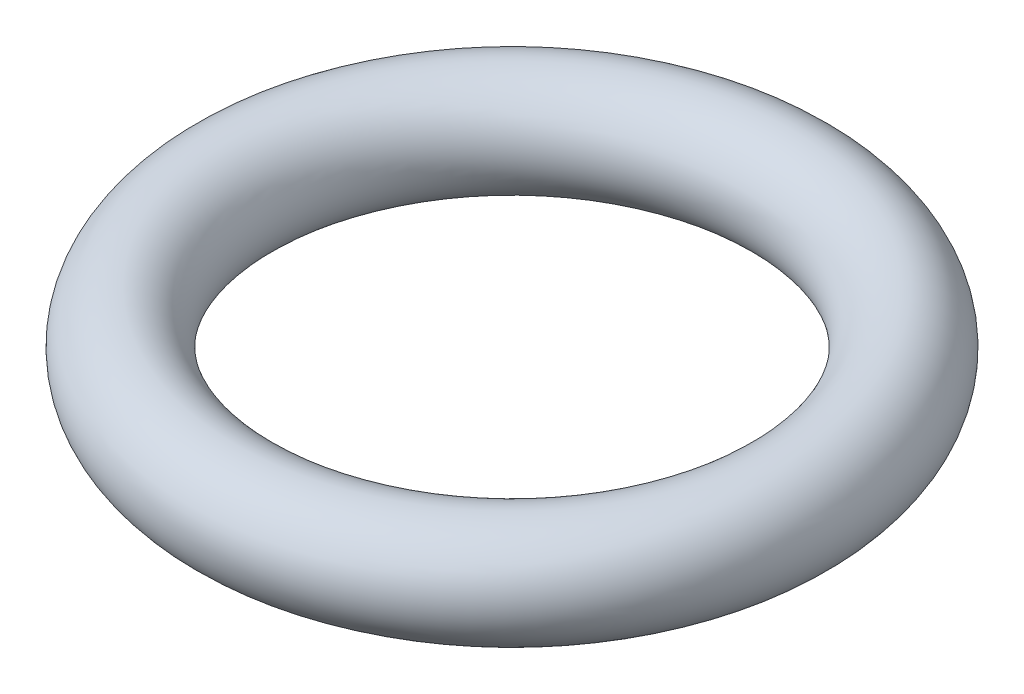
from build123d import *

# Parameters (mm, degrees)
SKETCH1_R = 1.190625


with BuildPart() as part:
    # Sketch1 → BASE SHAPE (revolve)
    with BuildSketch(Plane.XY, mode=Mode.PRIVATE) as base_shape_sk:
        with Locations((6.270625, 0)):
            Circle(SKETCH1_R)
    revolve(base_shape_sk.sketch.rotate(Axis((0, 0.254, 0), (0, -1, 0)), 90), axis=Axis((0, 0.254, 0), (0, -1, 0)))


solid = part.part
